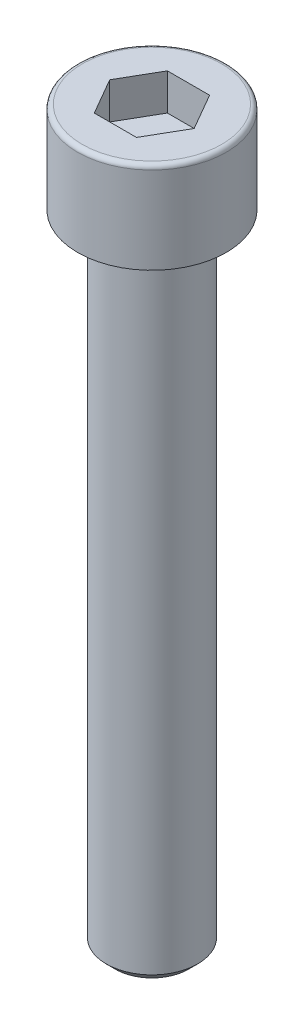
ISO-10303-21;
HEADER;
FILE_DESCRIPTION(('STEP AP214'),'2;1');
FILE_NAME('part.step','',(''),(''),'','','');
FILE_SCHEMA(('AUTOMOTIVE_DESIGN { 1 0 10303 214 1 1 1 1 }'));
ENDSEC;
DATA;
#1=APPLICATION_CONTEXT('core data for automotive mechanical design processes');
#2=APPLICATION_PROTOCOL_DEFINITION('international standard','automotive_design',2000,#1);
#3=PRODUCT_CONTEXT('',#1,'mechanical');
#4=PRODUCT('Part','Part','',(#3));
#5=PRODUCT_RELATED_PRODUCT_CATEGORY('part','',(#4));
#6=PRODUCT_DEFINITION_FORMATION('','',#4);
#7=PRODUCT_DEFINITION_CONTEXT('part definition',#1,'design');
#8=PRODUCT_DEFINITION('design','',#6,#7);
#9=PRODUCT_DEFINITION_SHAPE('','',#8);
#10=(LENGTH_UNIT() NAMED_UNIT(*) SI_UNIT(.MILLI.,.METRE.));
#11=(NAMED_UNIT(*) PLANE_ANGLE_UNIT() SI_UNIT($,.RADIAN.));
#12=(NAMED_UNIT(*) SI_UNIT($,.STERADIAN.) SOLID_ANGLE_UNIT());
#13=UNCERTAINTY_MEASURE_WITH_UNIT(LENGTH_MEASURE(1.E-05),#10,'distance_accuracy_value','');
#14=(GEOMETRIC_REPRESENTATION_CONTEXT(3) GLOBAL_UNCERTAINTY_ASSIGNED_CONTEXT((#13)) GLOBAL_UNIT_ASSIGNED_CONTEXT((#10,
#11,#12)) REPRESENTATION_CONTEXT('',''));
#15=CARTESIAN_POINT('',(0.,0.,0.));
#16=DIRECTION('',(0.,0.,1.));
#17=DIRECTION('',(1.,0.,0.));
#18=AXIS2_PLACEMENT_3D('',#15,#16,#17);
#19=CARTESIAN_POINT('',(-4.99999999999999,0.,0.));
#20=DIRECTION('',(0.,-1.,0.));
#21=DIRECTION('',(0.,0.,-1.));
#22=AXIS2_PLACEMENT_3D('',#19,#20,#21);
#23=PLANE('',#22);
#24=CARTESIAN_POINT('',(0.,0.,0.));
#25=DIRECTION('',(0.,-1.,0.));
#26=DIRECTION('',(0.,0.,-1.));
#27=AXIS2_PLACEMENT_3D('',#24,#25,#26);
#28=CIRCLE('',#27,3.99999999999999);
#29=CARTESIAN_POINT('',(0.,0.,-3.99999999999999));
#30=VERTEX_POINT('',#29);
#31=EDGE_CURVE('E11',#30,#30,#28,.T.);
#32=ORIENTED_EDGE('',*,*,#31,.T.);
#33=EDGE_LOOP('',(#32));
#34=FACE_BOUND('',#33,.T.);
#35=ADVANCED_FACE('F28',(#34),#23,.T.);
#36=CARTESIAN_POINT('',(0.,54.802767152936,0.));
#37=DIRECTION('',(0.,1.,0.));
#38=DIRECTION('',(0.,0.,1.));
#39=AXIS2_PLACEMENT_3D('',#36,#37,#38);
#40=CYLINDRICAL_SURFACE('',#39,5.);
#41=CARTESIAN_POINT('',(0.,1.00000000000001,0.));
#42=DIRECTION('',(0.,-1.,0.));
#43=DIRECTION('',(0.,0.,-1.));
#44=AXIS2_PLACEMENT_3D('',#41,#42,#43);
#45=CIRCLE('',#44,5.);
#46=CARTESIAN_POINT('',(0.,1.00000000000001,-5.));
#47=VERTEX_POINT('',#46);
#48=EDGE_CURVE('E35',#47,#47,#45,.F.);
#49=ORIENTED_EDGE('',*,*,#48,.T.);
#50=EDGE_LOOP('',(#49));
#51=FACE_BOUND('',#50,.T.);
#52=CARTESIAN_POINT('',(0.,70.,0.));
#53=DIRECTION('',(0.,1.,0.));
#54=DIRECTION('',(0.,0.,1.));
#55=AXIS2_PLACEMENT_3D('',#52,#53,#54);
#56=CIRCLE('',#55,5.);
#57=CARTESIAN_POINT('',(0.,70.,5.));
#58=VERTEX_POINT('',#57);
#59=EDGE_CURVE('E145',#58,#58,#56,.T.);
#60=ORIENTED_EDGE('',*,*,#59,.F.);
#61=EDGE_LOOP('',(#60));
#62=FACE_BOUND('',#61,.T.);
#63=ADVANCED_FACE('F150',(#51,#62),#40,.T.);
#64=CARTESIAN_POINT('',(-8.135,70.,0.));
#65=DIRECTION('',(0.,-1.,0.));
#66=DIRECTION('',(0.,0.,-1.));
#67=AXIS2_PLACEMENT_3D('',#64,#65,#66);
#68=PLANE('',#67);
#69=ORIENTED_EDGE('',*,*,#59,.T.);
#70=EDGE_LOOP('',(#69));
#71=FACE_BOUND('',#70,.T.);
#72=CARTESIAN_POINT('',(0.,70.,0.));
#73=DIRECTION('',(0.,1.,0.));
#74=DIRECTION('',(0.,0.,1.));
#75=AXIS2_PLACEMENT_3D('',#72,#73,#74);
#76=CIRCLE('',#75,8.135);
#77=CARTESIAN_POINT('',(0.,70.,8.135));
#78=VERTEX_POINT('',#77);
#79=EDGE_CURVE('E142',#78,#78,#76,.T.);
#80=ORIENTED_EDGE('',*,*,#79,.F.);
#81=EDGE_LOOP('',(#80));
#82=FACE_BOUND('',#81,.T.);
#83=ADVANCED_FACE('F172',(#71,#82),#68,.T.);
#84=CARTESIAN_POINT('',(0.,54.802767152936,0.));
#85=DIRECTION('',(0.,1.,0.));
#86=DIRECTION('',(0.,0.,1.));
#87=AXIS2_PLACEMENT_3D('',#84,#85,#86);
#88=CYLINDRICAL_SURFACE('',#87,8.135);
#89=ORIENTED_EDGE('',*,*,#79,.T.);
#90=EDGE_LOOP('',(#89));
#91=FACE_BOUND('',#90,.T.);
#92=CARTESIAN_POINT('',(0.,79.5,0.));
#93=DIRECTION('',(0.,1.,0.));
#94=DIRECTION('',(0.,0.,1.));
#95=AXIS2_PLACEMENT_3D('',#92,#93,#94);
#96=CIRCLE('',#95,8.135);
#97=CARTESIAN_POINT('',(0.,79.5,8.135));
#98=VERTEX_POINT('',#97);
#99=EDGE_CURVE('E139',#98,#98,#96,.T.);
#100=ORIENTED_EDGE('',*,*,#99,.F.);
#101=EDGE_LOOP('',(#100));
#102=FACE_BOUND('',#101,.T.);
#103=ADVANCED_FACE('F176',(#91,#102),#88,.T.);
#104=CARTESIAN_POINT('',(0.,79.5,0.));
#105=DIRECTION('',(0.,1.,0.));
#106=DIRECTION('',(0.,0.,1.));
#107=AXIS2_PLACEMENT_3D('',#104,#105,#106);
#108=TOROIDAL_SURFACE('',#107,7.635,0.5);
#109=CARTESIAN_POINT('',(0.,80.,0.));
#110=DIRECTION('',(0.,1.,0.));
#111=DIRECTION('',(0.,0.,1.));
#112=AXIS2_PLACEMENT_3D('',#109,#110,#111);
#113=CIRCLE('',#112,7.635);
#114=CARTESIAN_POINT('',(0.,80.,7.635));
#115=VERTEX_POINT('',#114);
#116=EDGE_CURVE('E130',#115,#115,#113,.T.);
#117=ORIENTED_EDGE('',*,*,#116,.F.);
#118=EDGE_LOOP('',(#117));
#119=FACE_BOUND('',#118,.T.);
#120=ORIENTED_EDGE('',*,*,#99,.T.);
#121=EDGE_LOOP('',(#120));
#122=FACE_BOUND('',#121,.T.);
#123=ADVANCED_FACE('F164',(#119,#122),#108,.T.);
#124=CARTESIAN_POINT('',(0.,80.,0.));
#125=DIRECTION('',(0.,1.,0.));
#126=DIRECTION('',(0.,0.,1.));
#127=AXIS2_PLACEMENT_3D('',#124,#125,#126);
#128=PLANE('',#127);
#129=DIRECTION('',(0.5,0.,0.866025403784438));
#130=VECTOR('',#129,1.);
#131=CARTESIAN_POINT('',(-4.61880215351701,80.,0.));
#132=LINE('',#131,#130);
#133=CARTESIAN_POINT('',(-4.61880215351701,80.,0.));
#134=VERTEX_POINT('',#133);
#135=CARTESIAN_POINT('',(-2.3094010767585,80.,4.));
#136=VERTEX_POINT('',#135);
#137=EDGE_CURVE('E42',#134,#136,#132,.T.);
#138=ORIENTED_EDGE('',*,*,#137,.F.);
#139=DIRECTION('',(-0.5,0.,0.866025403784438));
#140=VECTOR('',#139,1.);
#141=CARTESIAN_POINT('',(-2.3094010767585,80.,-4.));
#142=LINE('',#141,#140);
#143=CARTESIAN_POINT('',(-2.3094010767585,80.,-4.));
#144=VERTEX_POINT('',#143);
#145=EDGE_CURVE('E112',#144,#134,#142,.T.);
#146=ORIENTED_EDGE('',*,*,#145,.F.);
#147=DIRECTION('',(-1.,0.,0.));
#148=VECTOR('',#147,1.);
#149=CARTESIAN_POINT('',(2.3094010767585,80.,-4.));
#150=LINE('',#149,#148);
#151=CARTESIAN_POINT('',(2.3094010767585,80.,-4.));
#152=VERTEX_POINT('',#151);
#153=EDGE_CURVE('E106',#152,#144,#150,.T.);
#154=ORIENTED_EDGE('',*,*,#153,.F.);
#155=DIRECTION('',(-0.5,0.,-0.866025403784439));
#156=VECTOR('',#155,1.);
#157=CARTESIAN_POINT('',(4.61880215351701,80.,0.));
#158=LINE('',#157,#156);
#159=CARTESIAN_POINT('',(4.61880215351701,80.,0.));
#160=VERTEX_POINT('',#159);
#161=EDGE_CURVE('E104',#160,#152,#158,.T.);
#162=ORIENTED_EDGE('',*,*,#161,.F.);
#163=DIRECTION('',(0.5,0.,-0.866025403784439));
#164=VECTOR('',#163,1.);
#165=CARTESIAN_POINT('',(2.3094010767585,80.,4.));
#166=LINE('',#165,#164);
#167=CARTESIAN_POINT('',(2.3094010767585,80.,4.));
#168=VERTEX_POINT('',#167);
#169=EDGE_CURVE('E85',#168,#160,#166,.T.);
#170=ORIENTED_EDGE('',*,*,#169,.F.);
#171=DIRECTION('',(1.,0.,0.));
#172=VECTOR('',#171,1.);
#173=CARTESIAN_POINT('',(-2.3094010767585,80.,4.));
#174=LINE('',#173,#172);
#175=EDGE_CURVE('E96',#136,#168,#174,.T.);
#176=ORIENTED_EDGE('',*,*,#175,.F.);
#177=EDGE_LOOP('',(#138,#146,#154,#162,#170,#176));
#178=FACE_BOUND('',#177,.T.);
#179=ORIENTED_EDGE('',*,*,#116,.T.);
#180=EDGE_LOOP('',(#179));
#181=FACE_BOUND('',#180,.T.);
#182=ADVANCED_FACE('F100',(#178,#181),#128,.T.);
#183=CARTESIAN_POINT('',(0.,1.00000000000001,0.));
#184=DIRECTION('',(0.,1.,0.));
#185=DIRECTION('',(0.,0.,1.));
#186=AXIS2_PLACEMENT_3D('',#183,#184,#185);
#187=CONICAL_SURFACE('',#186,5.,0.785398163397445);
#188=ORIENTED_EDGE('',*,*,#31,.F.);
#189=EDGE_LOOP('',(#188));
#190=FACE_BOUND('',#189,.T.);
#191=ORIENTED_EDGE('',*,*,#48,.F.);
#192=EDGE_LOOP('',(#191));
#193=FACE_BOUND('',#192,.T.);
#194=ADVANCED_FACE('F153',(#190,#193),#187,.T.);
#195=CARTESIAN_POINT('',(-4.61880215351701,76.,0.));
#196=DIRECTION('',(-0.866025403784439,0.,0.5));
#197=DIRECTION('',(0.5,0.,0.866025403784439));
#198=AXIS2_PLACEMENT_3D('',#195,#196,#197);
#199=PLANE('',#198);
#200=ORIENTED_EDGE('',*,*,#137,.T.);
#201=DIRECTION('',(0.,1.,0.));
#202=VECTOR('',#201,1.);
#203=CARTESIAN_POINT('',(-2.3094010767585,76.,4.));
#204=LINE('',#203,#202);
#205=CARTESIAN_POINT('',(-2.3094010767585,76.,4.));
#206=VERTEX_POINT('',#205);
#207=EDGE_CURVE('E93',#206,#136,#204,.T.);
#208=ORIENTED_EDGE('',*,*,#207,.F.);
#209=DIRECTION('',(0.5,0.,0.866025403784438));
#210=VECTOR('',#209,1.);
#211=CARTESIAN_POINT('',(-4.61880215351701,76.,0.));
#212=LINE('',#211,#210);
#213=CARTESIAN_POINT('',(-4.61880215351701,76.,0.));
#214=VERTEX_POINT('',#213);
#215=EDGE_CURVE('E114',#214,#206,#212,.T.);
#216=ORIENTED_EDGE('',*,*,#215,.F.);
#217=DIRECTION('',(0.,1.,0.));
#218=VECTOR('',#217,1.);
#219=CARTESIAN_POINT('',(-4.61880215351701,76.,0.));
#220=LINE('',#219,#218);
#221=EDGE_CURVE('E49',#214,#134,#220,.T.);
#222=ORIENTED_EDGE('',*,*,#221,.T.);
#223=EDGE_LOOP('',(#200,#208,#216,#222));
#224=FACE_BOUND('',#223,.T.);
#225=ADVANCED_FACE('F155',(#224),#199,.F.);
#226=CARTESIAN_POINT('',(-2.3094010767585,76.,-4.));
#227=DIRECTION('',(-0.866025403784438,0.,-0.5));
#228=DIRECTION('',(-0.5,0.,0.866025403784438));
#229=AXIS2_PLACEMENT_3D('',#226,#227,#228);
#230=PLANE('',#229);
#231=ORIENTED_EDGE('',*,*,#145,.T.);
#232=ORIENTED_EDGE('',*,*,#221,.F.);
#233=DIRECTION('',(-0.5,0.,0.866025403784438));
#234=VECTOR('',#233,1.);
#235=CARTESIAN_POINT('',(-2.3094010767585,76.,-4.));
#236=LINE('',#235,#234);
#237=CARTESIAN_POINT('',(-2.3094010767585,76.,-4.));
#238=VERTEX_POINT('',#237);
#239=EDGE_CURVE('E126',#238,#214,#236,.T.);
#240=ORIENTED_EDGE('',*,*,#239,.F.);
#241=DIRECTION('',(0.,1.,0.));
#242=VECTOR('',#241,1.);
#243=CARTESIAN_POINT('',(-2.3094010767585,76.,-4.));
#244=LINE('',#243,#242);
#245=EDGE_CURVE('E131',#238,#144,#244,.T.);
#246=ORIENTED_EDGE('',*,*,#245,.T.);
#247=EDGE_LOOP('',(#231,#232,#240,#246));
#248=FACE_BOUND('',#247,.T.);
#249=ADVANCED_FACE('F162',(#248),#230,.F.);
#250=CARTESIAN_POINT('',(2.3094010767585,76.,-4.));
#251=DIRECTION('',(0.,0.,-1.));
#252=DIRECTION('',(-1.,0.,0.));
#253=AXIS2_PLACEMENT_3D('',#250,#251,#252);
#254=PLANE('',#253);
#255=ORIENTED_EDGE('',*,*,#153,.T.);
#256=ORIENTED_EDGE('',*,*,#245,.F.);
#257=DIRECTION('',(-1.,0.,0.));
#258=VECTOR('',#257,1.);
#259=CARTESIAN_POINT('',(2.3094010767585,76.,-4.));
#260=LINE('',#259,#258);
#261=CARTESIAN_POINT('',(2.3094010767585,76.,-4.));
#262=VERTEX_POINT('',#261);
#263=EDGE_CURVE('E123',#262,#238,#260,.T.);
#264=ORIENTED_EDGE('',*,*,#263,.F.);
#265=DIRECTION('',(0.,1.,0.));
#266=VECTOR('',#265,1.);
#267=CARTESIAN_POINT('',(2.3094010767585,76.,-4.));
#268=LINE('',#267,#266);
#269=EDGE_CURVE('E133',#262,#152,#268,.T.);
#270=ORIENTED_EDGE('',*,*,#269,.T.);
#271=EDGE_LOOP('',(#255,#256,#264,#270));
#272=FACE_BOUND('',#271,.T.);
#273=ADVANCED_FACE('F210',(#272),#254,.F.);
#274=CARTESIAN_POINT('',(4.61880215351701,76.,0.));
#275=DIRECTION('',(0.866025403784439,0.,-0.5));
#276=DIRECTION('',(-0.5,0.,-0.866025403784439));
#277=AXIS2_PLACEMENT_3D('',#274,#275,#276);
#278=PLANE('',#277);
#279=ORIENTED_EDGE('',*,*,#161,.T.);
#280=ORIENTED_EDGE('',*,*,#269,.F.);
#281=DIRECTION('',(-0.5,0.,-0.866025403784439));
#282=VECTOR('',#281,1.);
#283=CARTESIAN_POINT('',(4.61880215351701,76.,0.));
#284=LINE('',#283,#282);
#285=CARTESIAN_POINT('',(4.61880215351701,76.,0.));
#286=VERTEX_POINT('',#285);
#287=EDGE_CURVE('E120',#286,#262,#284,.T.);
#288=ORIENTED_EDGE('',*,*,#287,.F.);
#289=DIRECTION('',(0.,1.,0.));
#290=VECTOR('',#289,1.);
#291=CARTESIAN_POINT('',(4.61880215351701,76.,0.));
#292=LINE('',#291,#290);
#293=EDGE_CURVE('E92',#286,#160,#292,.T.);
#294=ORIENTED_EDGE('',*,*,#293,.T.);
#295=EDGE_LOOP('',(#279,#280,#288,#294));
#296=FACE_BOUND('',#295,.T.);
#297=ADVANCED_FACE('F217',(#296),#278,.F.);
#298=CARTESIAN_POINT('',(2.3094010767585,76.,4.));
#299=DIRECTION('',(0.866025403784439,0.,0.5));
#300=DIRECTION('',(0.5,0.,-0.866025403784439));
#301=AXIS2_PLACEMENT_3D('',#298,#299,#300);
#302=PLANE('',#301);
#303=ORIENTED_EDGE('',*,*,#169,.T.);
#304=ORIENTED_EDGE('',*,*,#293,.F.);
#305=DIRECTION('',(0.5,0.,-0.866025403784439));
#306=VECTOR('',#305,1.);
#307=CARTESIAN_POINT('',(2.3094010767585,76.,4.));
#308=LINE('',#307,#306);
#309=CARTESIAN_POINT('',(2.3094010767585,76.,4.));
#310=VERTEX_POINT('',#309);
#311=EDGE_CURVE('E88',#310,#286,#308,.T.);
#312=ORIENTED_EDGE('',*,*,#311,.F.);
#313=DIRECTION('',(0.,1.,0.));
#314=VECTOR('',#313,1.);
#315=CARTESIAN_POINT('',(2.3094010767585,76.,4.));
#316=LINE('',#315,#314);
#317=EDGE_CURVE('E81',#310,#168,#316,.T.);
#318=ORIENTED_EDGE('',*,*,#317,.T.);
#319=EDGE_LOOP('',(#303,#304,#312,#318));
#320=FACE_BOUND('',#319,.T.);
#321=ADVANCED_FACE('F83',(#320),#302,.F.);
#322=CARTESIAN_POINT('',(-2.3094010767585,76.,4.));
#323=DIRECTION('',(0.,0.,1.));
#324=DIRECTION('',(1.,0.,0.));
#325=AXIS2_PLACEMENT_3D('',#322,#323,#324);
#326=PLANE('',#325);
#327=ORIENTED_EDGE('',*,*,#175,.T.);
#328=ORIENTED_EDGE('',*,*,#317,.F.);
#329=DIRECTION('',(1.,0.,0.));
#330=VECTOR('',#329,1.);
#331=CARTESIAN_POINT('',(-2.3094010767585,76.,4.));
#332=LINE('',#331,#330);
#333=EDGE_CURVE('E117',#206,#310,#332,.T.);
#334=ORIENTED_EDGE('',*,*,#333,.F.);
#335=ORIENTED_EDGE('',*,*,#207,.T.);
#336=EDGE_LOOP('',(#327,#328,#334,#335));
#337=FACE_BOUND('',#336,.T.);
#338=ADVANCED_FACE('F97',(#337),#326,.F.);
#339=CARTESIAN_POINT('',(-4.61880215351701,76.,0.));
#340=DIRECTION('',(0.,-1.,0.));
#341=DIRECTION('',(0.,0.,-1.));
#342=AXIS2_PLACEMENT_3D('',#339,#340,#341);
#343=PLANE('',#342);
#344=ORIENTED_EDGE('',*,*,#215,.T.);
#345=ORIENTED_EDGE('',*,*,#333,.T.);
#346=ORIENTED_EDGE('',*,*,#311,.T.);
#347=ORIENTED_EDGE('',*,*,#287,.T.);
#348=ORIENTED_EDGE('',*,*,#263,.T.);
#349=ORIENTED_EDGE('',*,*,#239,.T.);
#350=EDGE_LOOP('',(#344,#345,#346,#347,#348,#349));
#351=FACE_BOUND('',#350,.T.);
#352=ADVANCED_FACE('F238',(#351),#343,.F.);
#353=CLOSED_SHELL('',(#35,#63,#83,#103,#123,#182,#194,#225,#249,#273,#297,#321,#338,#352));
#354=MANIFOLD_SOLID_BREP('B2',#353);
#355=ADVANCED_BREP_SHAPE_REPRESENTATION('',(#18,#354),#14);
#356=SHAPE_DEFINITION_REPRESENTATION(#9,#355);
ENDSEC;
END-ISO-10303-21;
